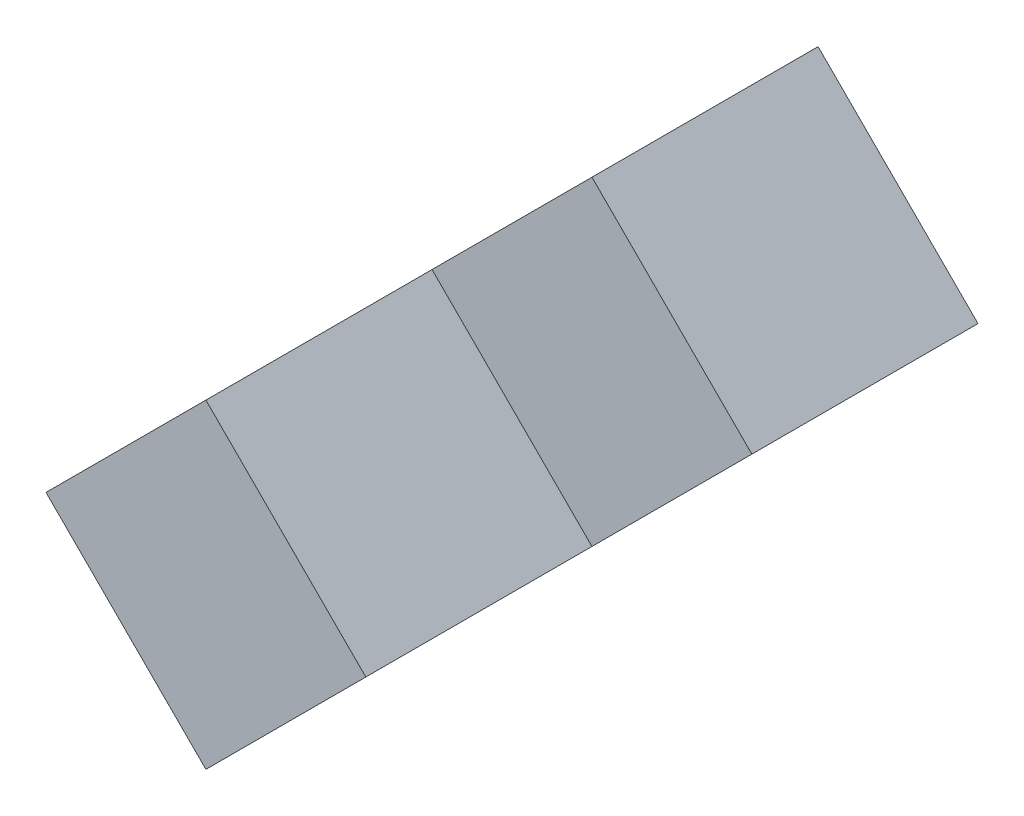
ISO-10303-21;
HEADER;
FILE_DESCRIPTION(('STEP AP214'),'2;1');
FILE_NAME('part.step','',(''),(''),'','','');
FILE_SCHEMA(('AUTOMOTIVE_DESIGN { 1 0 10303 214 1 1 1 1 }'));
ENDSEC;
DATA;
#1=APPLICATION_CONTEXT('core data for automotive mechanical design processes');
#2=APPLICATION_PROTOCOL_DEFINITION('international standard','automotive_design',2000,#1);
#3=PRODUCT_CONTEXT('',#1,'mechanical');
#4=PRODUCT('Part','Part','',(#3));
#5=PRODUCT_RELATED_PRODUCT_CATEGORY('part','',(#4));
#6=PRODUCT_DEFINITION_FORMATION('','',#4);
#7=PRODUCT_DEFINITION_CONTEXT('part definition',#1,'design');
#8=PRODUCT_DEFINITION('design','',#6,#7);
#9=PRODUCT_DEFINITION_SHAPE('','',#8);
#10=(LENGTH_UNIT() NAMED_UNIT(*) SI_UNIT(.MILLI.,.METRE.));
#11=(NAMED_UNIT(*) PLANE_ANGLE_UNIT() SI_UNIT($,.RADIAN.));
#12=(NAMED_UNIT(*) SI_UNIT($,.STERADIAN.) SOLID_ANGLE_UNIT());
#13=UNCERTAINTY_MEASURE_WITH_UNIT(LENGTH_MEASURE(1.E-05),#10,'distance_accuracy_value','');
#14=(GEOMETRIC_REPRESENTATION_CONTEXT(3) GLOBAL_UNCERTAINTY_ASSIGNED_CONTEXT((#13)) GLOBAL_UNIT_ASSIGNED_CONTEXT((#10,
#11,#12)) REPRESENTATION_CONTEXT('',''));
#15=CARTESIAN_POINT('',(0.,0.,0.));
#16=DIRECTION('',(0.,0.,1.));
#17=DIRECTION('',(1.,0.,0.));
#18=AXIS2_PLACEMENT_3D('',#15,#16,#17);
#19=CARTESIAN_POINT('',(7.07106781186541,35.3553390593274,26.8038845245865));
#20=DIRECTION('',(-0.707106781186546,-0.707106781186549,0.));
#21=DIRECTION('',(0.707106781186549,-0.707106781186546,0.));
#22=AXIS2_PLACEMENT_3D('',#19,#20,#21);
#23=PLANE('',#22);
#24=DIRECTION('',(0.,0.,-1.));
#25=VECTOR('',#24,1.);
#26=CARTESIAN_POINT('',(21.2132034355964,21.2132034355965,26.8038845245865));
#27=LINE('',#26,#25);
#28=CARTESIAN_POINT('',(21.2132034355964,21.2132034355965,46.8038845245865));
#29=VERTEX_POINT('',#28);
#30=CARTESIAN_POINT('',(21.2132034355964,21.2132034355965,26.8038845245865));
#31=VERTEX_POINT('',#30);
#32=EDGE_CURVE('E126',#29,#31,#27,.T.);
#33=ORIENTED_EDGE('',*,*,#32,.T.);
#34=DIRECTION('',(0.707106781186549,-0.707106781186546,0.));
#35=VECTOR('',#34,1.);
#36=CARTESIAN_POINT('',(7.07106781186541,35.3553390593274,26.8038845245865));
#37=LINE('',#36,#35);
#38=CARTESIAN_POINT('',(7.07106781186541,35.3553390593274,26.8038845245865));
#39=VERTEX_POINT('',#38);
#40=EDGE_CURVE('E11',#39,#31,#37,.T.);
#41=ORIENTED_EDGE('',*,*,#40,.F.);
#42=DIRECTION('',(0.,0.,-1.));
#43=VECTOR('',#42,1.);
#44=CARTESIAN_POINT('',(7.07106781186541,35.3553390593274,26.8038845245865));
#45=LINE('',#44,#43);
#46=CARTESIAN_POINT('',(7.07106781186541,35.3553390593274,46.8038845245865));
#47=VERTEX_POINT('',#46);
#48=EDGE_CURVE('E140',#47,#39,#45,.T.);
#49=ORIENTED_EDGE('',*,*,#48,.F.);
#50=DIRECTION('',(0.707106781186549,-0.707106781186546,0.));
#51=VECTOR('',#50,1.);
#52=CARTESIAN_POINT('',(7.07106781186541,35.3553390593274,46.8038845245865));
#53=LINE('',#52,#51);
#54=EDGE_CURVE('E122',#47,#29,#53,.T.);
#55=ORIENTED_EDGE('',*,*,#54,.T.);
#56=EDGE_LOOP('',(#33,#41,#49,#55));
#57=FACE_BOUND('',#56,.T.);
#58=ADVANCED_FACE('F30',(#57),#23,.F.);
#59=CARTESIAN_POINT('',(7.07106781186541,35.3553390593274,26.8038845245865));
#60=DIRECTION('',(0.,0.,1.));
#61=DIRECTION('',(1.,0.,0.));
#62=AXIS2_PLACEMENT_3D('',#59,#60,#61);
#63=PLANE('',#62);
#64=DIRECTION('',(-0.707106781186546,-0.707106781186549,0.));
#65=VECTOR('',#64,1.);
#66=CARTESIAN_POINT('',(21.2132034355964,21.2132034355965,26.8038845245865));
#67=LINE('',#66,#65);
#68=CARTESIAN_POINT('',(-21.2132034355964,-21.2132034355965,26.8038845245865));
#69=VERTEX_POINT('',#68);
#70=EDGE_CURVE('E129',#31,#69,#67,.T.);
#71=ORIENTED_EDGE('',*,*,#70,.T.);
#72=DIRECTION('',(0.707106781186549,-0.707106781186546,0.));
#73=VECTOR('',#72,1.);
#74=CARTESIAN_POINT('',(-35.3553390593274,-7.07106781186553,26.8038845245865));
#75=LINE('',#74,#73);
#76=CARTESIAN_POINT('',(-35.3553390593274,-7.07106781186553,26.8038845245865));
#77=VERTEX_POINT('',#76);
#78=EDGE_CURVE('E38',#77,#69,#75,.T.);
#79=ORIENTED_EDGE('',*,*,#78,.F.);
#80=DIRECTION('',(-0.707106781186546,-0.707106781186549,0.));
#81=VECTOR('',#80,1.);
#82=CARTESIAN_POINT('',(7.07106781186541,35.3553390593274,26.8038845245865));
#83=LINE('',#82,#81);
#84=EDGE_CURVE('E89',#39,#77,#83,.T.);
#85=ORIENTED_EDGE('',*,*,#84,.F.);
#86=ORIENTED_EDGE('',*,*,#40,.T.);
#87=EDGE_LOOP('',(#71,#79,#85,#86));
#88=FACE_BOUND('',#87,.T.);
#89=ADVANCED_FACE('F175',(#88),#63,.F.);
#90=CARTESIAN_POINT('',(-35.3553390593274,-7.07106781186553,26.8038845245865));
#91=DIRECTION('',(0.707106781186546,0.707106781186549,0.));
#92=DIRECTION('',(-0.707106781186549,0.707106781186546,0.));
#93=AXIS2_PLACEMENT_3D('',#90,#91,#92);
#94=PLANE('',#93);
#95=DIRECTION('',(0.,0.,1.));
#96=VECTOR('',#95,1.);
#97=CARTESIAN_POINT('',(-21.2132034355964,-21.2132034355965,26.8038845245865));
#98=LINE('',#97,#96);
#99=CARTESIAN_POINT('',(-21.2132034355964,-21.2132034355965,46.8038845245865));
#100=VERTEX_POINT('',#99);
#101=EDGE_CURVE('E131',#69,#100,#98,.T.);
#102=ORIENTED_EDGE('',*,*,#101,.T.);
#103=DIRECTION('',(0.707106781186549,-0.707106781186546,0.));
#104=VECTOR('',#103,1.);
#105=CARTESIAN_POINT('',(-35.3553390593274,-7.07106781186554,46.8038845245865));
#106=LINE('',#105,#104);
#107=CARTESIAN_POINT('',(-35.3553390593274,-7.07106781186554,46.8038845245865));
#108=VERTEX_POINT('',#107);
#109=EDGE_CURVE('E147',#108,#100,#106,.T.);
#110=ORIENTED_EDGE('',*,*,#109,.F.);
#111=DIRECTION('',(0.,0.,1.));
#112=VECTOR('',#111,1.);
#113=CARTESIAN_POINT('',(-35.3553390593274,-7.07106781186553,26.8038845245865));
#114=LINE('',#113,#112);
#115=EDGE_CURVE('E155',#77,#108,#114,.T.);
#116=ORIENTED_EDGE('',*,*,#115,.F.);
#117=ORIENTED_EDGE('',*,*,#78,.T.);
#118=EDGE_LOOP('',(#102,#110,#116,#117));
#119=FACE_BOUND('',#118,.T.);
#120=ADVANCED_FACE('F153',(#119),#94,.F.);
#121=CARTESIAN_POINT('',(-35.3553390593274,-7.07106781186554,46.8038845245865));
#122=DIRECTION('',(0.,0.,-1.));
#123=DIRECTION('',(-1.,0.,0.));
#124=AXIS2_PLACEMENT_3D('',#121,#122,#123);
#125=PLANE('',#124);
#126=DIRECTION('',(0.707106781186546,0.707106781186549,0.));
#127=VECTOR('',#126,1.);
#128=CARTESIAN_POINT('',(-21.2132034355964,-21.2132034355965,46.8038845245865));
#129=LINE('',#128,#127);
#130=CARTESIAN_POINT('',(-7.07106781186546,-7.07106781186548,46.8038845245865));
#131=VERTEX_POINT('',#130);
#132=EDGE_CURVE('E133',#100,#131,#129,.T.);
#133=ORIENTED_EDGE('',*,*,#132,.T.);
#134=DIRECTION('',(0.707106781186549,-0.707106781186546,0.));
#135=VECTOR('',#134,1.);
#136=CARTESIAN_POINT('',(-21.2132034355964,7.07106781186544,46.8038845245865));
#137=LINE('',#136,#135);
#138=CARTESIAN_POINT('',(-21.2132034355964,7.07106781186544,46.8038845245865));
#139=VERTEX_POINT('',#138);
#140=EDGE_CURVE('E144',#139,#131,#137,.T.);
#141=ORIENTED_EDGE('',*,*,#140,.F.);
#142=DIRECTION('',(0.707106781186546,0.707106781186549,0.));
#143=VECTOR('',#142,1.);
#144=CARTESIAN_POINT('',(-35.3553390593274,-7.07106781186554,46.8038845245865));
#145=LINE('',#144,#143);
#146=EDGE_CURVE('E167',#108,#139,#145,.T.);
#147=ORIENTED_EDGE('',*,*,#146,.F.);
#148=ORIENTED_EDGE('',*,*,#109,.T.);
#149=EDGE_LOOP('',(#133,#141,#147,#148));
#150=FACE_BOUND('',#149,.T.);
#151=ADVANCED_FACE('F163',(#150),#125,.F.);
#152=CARTESIAN_POINT('',(-21.2132034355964,7.07106781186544,46.8038845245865));
#153=DIRECTION('',(0.707106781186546,0.707106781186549,0.));
#154=DIRECTION('',(-0.707106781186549,0.707106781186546,0.));
#155=AXIS2_PLACEMENT_3D('',#152,#153,#154);
#156=PLANE('',#155);
#157=DIRECTION('',(0.,0.,1.));
#158=VECTOR('',#157,1.);
#159=CARTESIAN_POINT('',(-7.07106781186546,-7.07106781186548,46.8038845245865));
#160=LINE('',#159,#158);
#161=CARTESIAN_POINT('',(-7.07106781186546,-7.07106781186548,66.8038845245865));
#162=VERTEX_POINT('',#161);
#163=EDGE_CURVE('E135',#131,#162,#160,.T.);
#164=ORIENTED_EDGE('',*,*,#163,.T.);
#165=DIRECTION('',(0.707106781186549,-0.707106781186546,0.));
#166=VECTOR('',#165,1.);
#167=CARTESIAN_POINT('',(-21.2132034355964,7.07106781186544,66.8038845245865));
#168=LINE('',#167,#166);
#169=CARTESIAN_POINT('',(-21.2132034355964,7.07106781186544,66.8038845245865));
#170=VERTEX_POINT('',#169);
#171=EDGE_CURVE('E117',#170,#162,#168,.T.);
#172=ORIENTED_EDGE('',*,*,#171,.F.);
#173=DIRECTION('',(0.,0.,1.));
#174=VECTOR('',#173,1.);
#175=CARTESIAN_POINT('',(-21.2132034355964,7.07106781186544,46.8038845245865));
#176=LINE('',#175,#174);
#177=EDGE_CURVE('E108',#139,#170,#176,.T.);
#178=ORIENTED_EDGE('',*,*,#177,.F.);
#179=ORIENTED_EDGE('',*,*,#140,.T.);
#180=EDGE_LOOP('',(#164,#172,#178,#179));
#181=FACE_BOUND('',#180,.T.);
#182=ADVANCED_FACE('F166',(#181),#156,.F.);
#183=CARTESIAN_POINT('',(-7.07106781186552,21.2132034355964,66.8038845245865));
#184=DIRECTION('',(0.,0.,-1.));
#185=DIRECTION('',(-1.,0.,0.));
#186=AXIS2_PLACEMENT_3D('',#183,#184,#185);
#187=PLANE('',#186);
#188=DIRECTION('',(0.707106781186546,0.707106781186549,0.));
#189=VECTOR('',#188,1.);
#190=CARTESIAN_POINT('',(7.07106781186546,7.07106781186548,66.8038845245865));
#191=LINE('',#190,#189);
#192=CARTESIAN_POINT('',(7.07106781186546,7.07106781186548,66.8038845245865));
#193=VERTEX_POINT('',#192);
#194=EDGE_CURVE('E116',#162,#193,#191,.T.);
#195=ORIENTED_EDGE('',*,*,#194,.T.);
#196=DIRECTION('',(0.707106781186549,-0.707106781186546,0.));
#197=VECTOR('',#196,1.);
#198=CARTESIAN_POINT('',(-7.07106781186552,21.2132034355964,66.8038845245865));
#199=LINE('',#198,#197);
#200=CARTESIAN_POINT('',(-7.07106781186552,21.2132034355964,66.8038845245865));
#201=VERTEX_POINT('',#200);
#202=EDGE_CURVE('E113',#201,#193,#199,.T.);
#203=ORIENTED_EDGE('',*,*,#202,.F.);
#204=DIRECTION('',(0.707106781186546,0.707106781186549,0.));
#205=VECTOR('',#204,1.);
#206=CARTESIAN_POINT('',(-7.07106781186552,21.2132034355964,66.8038845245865));
#207=LINE('',#206,#205);
#208=EDGE_CURVE('E102',#170,#201,#207,.T.);
#209=ORIENTED_EDGE('',*,*,#208,.F.);
#210=ORIENTED_EDGE('',*,*,#171,.T.);
#211=EDGE_LOOP('',(#195,#203,#209,#210));
#212=FACE_BOUND('',#211,.T.);
#213=ADVANCED_FACE('F114',(#212),#187,.F.);
#214=CARTESIAN_POINT('',(-7.07106781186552,21.2132034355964,46.8038845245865));
#215=DIRECTION('',(-0.707106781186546,-0.707106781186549,0.));
#216=DIRECTION('',(0.707106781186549,-0.707106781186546,0.));
#217=AXIS2_PLACEMENT_3D('',#214,#215,#216);
#218=PLANE('',#217);
#219=DIRECTION('',(0.,0.,-1.));
#220=VECTOR('',#219,1.);
#221=CARTESIAN_POINT('',(7.07106781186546,7.07106781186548,46.8038845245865));
#222=LINE('',#221,#220);
#223=CARTESIAN_POINT('',(7.07106781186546,7.07106781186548,46.8038845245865));
#224=VERTEX_POINT('',#223);
#225=EDGE_CURVE('E75',#193,#224,#222,.T.);
#226=ORIENTED_EDGE('',*,*,#225,.T.);
#227=DIRECTION('',(0.707106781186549,-0.707106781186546,0.));
#228=VECTOR('',#227,1.);
#229=CARTESIAN_POINT('',(-7.07106781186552,21.2132034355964,46.8038845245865));
#230=LINE('',#229,#228);
#231=CARTESIAN_POINT('',(-7.07106781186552,21.2132034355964,46.8038845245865));
#232=VERTEX_POINT('',#231);
#233=EDGE_CURVE('E118',#232,#224,#230,.T.);
#234=ORIENTED_EDGE('',*,*,#233,.F.);
#235=DIRECTION('',(0.,0.,-1.));
#236=VECTOR('',#235,1.);
#237=CARTESIAN_POINT('',(-7.07106781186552,21.2132034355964,46.8038845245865));
#238=LINE('',#237,#236);
#239=EDGE_CURVE('E106',#201,#232,#238,.T.);
#240=ORIENTED_EDGE('',*,*,#239,.F.);
#241=ORIENTED_EDGE('',*,*,#202,.T.);
#242=EDGE_LOOP('',(#226,#234,#240,#241));
#243=FACE_BOUND('',#242,.T.);
#244=ADVANCED_FACE('F120',(#243),#218,.F.);
#245=CARTESIAN_POINT('',(7.07106781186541,35.3553390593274,46.8038845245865));
#246=DIRECTION('',(0.,0.,-1.));
#247=DIRECTION('',(-1.,0.,0.));
#248=AXIS2_PLACEMENT_3D('',#245,#246,#247);
#249=PLANE('',#248);
#250=DIRECTION('',(0.707106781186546,0.707106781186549,0.));
#251=VECTOR('',#250,1.);
#252=CARTESIAN_POINT('',(21.2132034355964,21.2132034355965,46.8038845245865));
#253=LINE('',#252,#251);
#254=EDGE_CURVE('E81',#224,#29,#253,.T.);
#255=ORIENTED_EDGE('',*,*,#254,.T.);
#256=ORIENTED_EDGE('',*,*,#54,.F.);
#257=DIRECTION('',(0.707106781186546,0.707106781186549,0.));
#258=VECTOR('',#257,1.);
#259=CARTESIAN_POINT('',(7.07106781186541,35.3553390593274,46.8038845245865));
#260=LINE('',#259,#258);
#261=EDGE_CURVE('E46',#232,#47,#260,.T.);
#262=ORIENTED_EDGE('',*,*,#261,.F.);
#263=ORIENTED_EDGE('',*,*,#233,.T.);
#264=EDGE_LOOP('',(#255,#256,#262,#263));
#265=FACE_BOUND('',#264,.T.);
#266=ADVANCED_FACE('F191',(#265),#249,.F.);
#267=CARTESIAN_POINT('',(7.07106781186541,35.3553390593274,46.8038845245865));
#268=DIRECTION('',(0.707106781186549,-0.707106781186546,0.));
#269=DIRECTION('',(0.707106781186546,0.707106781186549,0.));
#270=AXIS2_PLACEMENT_3D('',#267,#268,#269);
#271=PLANE('',#270);
#272=ORIENTED_EDGE('',*,*,#48,.T.);
#273=ORIENTED_EDGE('',*,*,#84,.T.);
#274=ORIENTED_EDGE('',*,*,#115,.T.);
#275=ORIENTED_EDGE('',*,*,#146,.T.);
#276=ORIENTED_EDGE('',*,*,#177,.T.);
#277=ORIENTED_EDGE('',*,*,#208,.T.);
#278=ORIENTED_EDGE('',*,*,#239,.T.);
#279=ORIENTED_EDGE('',*,*,#261,.T.);
#280=EDGE_LOOP('',(#272,#273,#274,#275,#276,#277,#278,#279));
#281=FACE_BOUND('',#280,.T.);
#282=ADVANCED_FACE('F104',(#281),#271,.F.);
#283=CARTESIAN_POINT('',(21.2132034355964,21.2132034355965,46.8038845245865));
#284=DIRECTION('',(0.707106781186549,-0.707106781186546,0.));
#285=DIRECTION('',(0.707106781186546,0.707106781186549,0.));
#286=AXIS2_PLACEMENT_3D('',#283,#284,#285);
#287=PLANE('',#286);
#288=ORIENTED_EDGE('',*,*,#32,.F.);
#289=ORIENTED_EDGE('',*,*,#254,.F.);
#290=ORIENTED_EDGE('',*,*,#225,.F.);
#291=ORIENTED_EDGE('',*,*,#194,.F.);
#292=ORIENTED_EDGE('',*,*,#163,.F.);
#293=ORIENTED_EDGE('',*,*,#132,.F.);
#294=ORIENTED_EDGE('',*,*,#101,.F.);
#295=ORIENTED_EDGE('',*,*,#70,.F.);
#296=EDGE_LOOP('',(#288,#289,#290,#291,#292,#293,#294,#295));
#297=FACE_BOUND('',#296,.T.);
#298=ADVANCED_FACE('F159',(#297),#287,.T.);
#299=CLOSED_SHELL('',(#58,#89,#120,#151,#182,#213,#244,#266,#282,#298));
#300=MANIFOLD_SOLID_BREP('B2',#299);
#301=ADVANCED_BREP_SHAPE_REPRESENTATION('',(#18,#300),#14);
#302=SHAPE_DEFINITION_REPRESENTATION(#9,#301);
ENDSEC;
END-ISO-10303-21;
